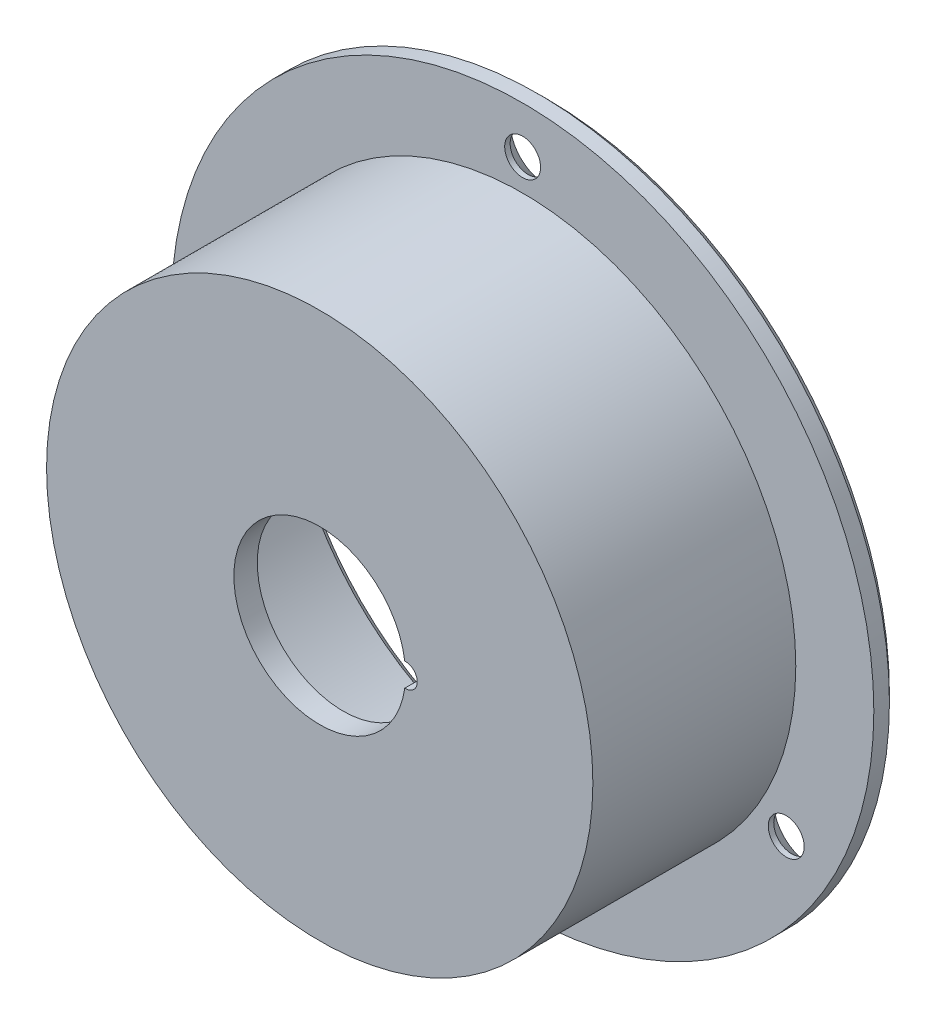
ISO-10303-21;
HEADER;
FILE_DESCRIPTION(('STEP AP214'),'2;1');
FILE_NAME('part.step','',(''),(''),'','','');
FILE_SCHEMA(('AUTOMOTIVE_DESIGN { 1 0 10303 214 1 1 1 1 }'));
ENDSEC;
DATA;
#1=APPLICATION_CONTEXT('core data for automotive mechanical design processes');
#2=APPLICATION_PROTOCOL_DEFINITION('international standard','automotive_design',2000,#1);
#3=PRODUCT_CONTEXT('',#1,'mechanical');
#4=PRODUCT('Part','Part','',(#3));
#5=PRODUCT_RELATED_PRODUCT_CATEGORY('part','',(#4));
#6=PRODUCT_DEFINITION_FORMATION('','',#4);
#7=PRODUCT_DEFINITION_CONTEXT('part definition',#1,'design');
#8=PRODUCT_DEFINITION('design','',#6,#7);
#9=PRODUCT_DEFINITION_SHAPE('','',#8);
#10=(LENGTH_UNIT() NAMED_UNIT(*) SI_UNIT(.MILLI.,.METRE.));
#11=(NAMED_UNIT(*) PLANE_ANGLE_UNIT() SI_UNIT($,.RADIAN.));
#12=(NAMED_UNIT(*) SI_UNIT($,.STERADIAN.) SOLID_ANGLE_UNIT());
#13=UNCERTAINTY_MEASURE_WITH_UNIT(LENGTH_MEASURE(1.E-05),#10,'distance_accuracy_value','');
#14=(GEOMETRIC_REPRESENTATION_CONTEXT(3) GLOBAL_UNCERTAINTY_ASSIGNED_CONTEXT((#13)) GLOBAL_UNIT_ASSIGNED_CONTEXT((#10,
#11,#12)) REPRESENTATION_CONTEXT('',''));
#15=CARTESIAN_POINT('',(0.,0.,0.));
#16=DIRECTION('',(0.,0.,1.));
#17=DIRECTION('',(1.,0.,0.));
#18=AXIS2_PLACEMENT_3D('',#15,#16,#17);
#19=CARTESIAN_POINT('',(0.,0.,3.));
#20=DIRECTION('',(0.,0.,1.));
#21=DIRECTION('',(1.,0.,0.));
#22=AXIS2_PLACEMENT_3D('',#19,#20,#21);
#23=PLANE('',#22);
#24=CARTESIAN_POINT('',(-33.7749907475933,-19.4999999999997,3.));
#25=DIRECTION('',(0.,0.,1.));
#26=DIRECTION('',(-0.499999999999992,0.866025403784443,0.));
#27=AXIS2_PLACEMENT_3D('',#24,#25,#26);
#28=CIRCLE('',#27,2.3);
#29=CARTESIAN_POINT('',(-34.9249907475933,-17.5081415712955,3.));
#30=VERTEX_POINT('',#29);
#31=EDGE_CURVE('E323',#30,#30,#28,.T.);
#32=ORIENTED_EDGE('',*,*,#31,.F.);
#33=EDGE_LOOP('',(#32));
#34=FACE_BOUND('',#33,.T.);
#35=CARTESIAN_POINT('',(33.774990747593,-19.5000000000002,3.));
#36=DIRECTION('',(0.,0.,1.));
#37=DIRECTION('',(-0.500000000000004,-0.866025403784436,0.));
#38=AXIS2_PLACEMENT_3D('',#35,#36,#37);
#39=CIRCLE('',#38,2.3);
#40=CARTESIAN_POINT('',(32.624990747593,-21.4918584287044,3.));
#41=VERTEX_POINT('',#40);
#42=EDGE_CURVE('E327',#41,#41,#39,.T.);
#43=ORIENTED_EDGE('',*,*,#42,.F.);
#44=EDGE_LOOP('',(#43));
#45=FACE_BOUND('',#44,.T.);
#46=CARTESIAN_POINT('',(0.,39.,3.));
#47=DIRECTION('',(0.,0.,1.));
#48=DIRECTION('',(1.,0.,0.));
#49=AXIS2_PLACEMENT_3D('',#46,#47,#48);
#50=CIRCLE('',#49,2.3);
#51=CARTESIAN_POINT('',(2.3,39.,3.));
#52=VERTEX_POINT('',#51);
#53=EDGE_CURVE('E87',#52,#52,#50,.T.);
#54=ORIENTED_EDGE('',*,*,#53,.F.);
#55=EDGE_LOOP('',(#54));
#56=FACE_BOUND('',#55,.T.);
#57=CARTESIAN_POINT('',(0.,0.,3.));
#58=DIRECTION('',(0.,0.,1.));
#59=DIRECTION('',(1.,0.,0.));
#60=AXIS2_PLACEMENT_3D('',#57,#58,#59);
#61=CIRCLE('',#60,45.);
#62=CARTESIAN_POINT('',(45.,0.,3.));
#63=VERTEX_POINT('',#62);
#64=EDGE_CURVE('E97',#63,#63,#61,.T.);
#65=ORIENTED_EDGE('',*,*,#64,.T.);
#66=EDGE_LOOP('',(#65));
#67=FACE_BOUND('',#66,.T.);
#68=CARTESIAN_POINT('',(0.,0.,3.));
#69=DIRECTION('',(0.,0.,1.));
#70=DIRECTION('',(1.,0.,0.));
#71=AXIS2_PLACEMENT_3D('',#68,#69,#70);
#72=CIRCLE('',#71,35.);
#73=CARTESIAN_POINT('',(35.,0.,3.));
#74=VERTEX_POINT('',#73);
#75=EDGE_CURVE('E94',#74,#74,#72,.T.);
#76=ORIENTED_EDGE('',*,*,#75,.F.);
#77=EDGE_LOOP('',(#76));
#78=FACE_BOUND('',#77,.T.);
#79=ADVANCED_FACE('F41',(#34,#45,#56,#67,#78),#23,.T.);
#80=CARTESIAN_POINT('',(0.,0.,0.));
#81=DIRECTION('',(0.,0.,1.));
#82=DIRECTION('',(1.,0.,0.));
#83=AXIS2_PLACEMENT_3D('',#80,#81,#82);
#84=PLANE('',#83);
#85=CARTESIAN_POINT('',(-33.7749907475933,-19.4999999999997,0.));
#86=DIRECTION('',(0.,0.,1.));
#87=DIRECTION('',(1.,0.,0.));
#88=AXIS2_PLACEMENT_3D('',#85,#86,#87);
#89=CIRCLE('',#88,4.60000000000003);
#90=CARTESIAN_POINT('',(-38.3749907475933,-19.4999999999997,0.));
#91=VERTEX_POINT('',#90);
#92=EDGE_CURVE('E133',#91,#91,#89,.T.);
#93=ORIENTED_EDGE('',*,*,#92,.T.);
#94=EDGE_LOOP('',(#93));
#95=FACE_BOUND('',#94,.T.);
#96=CARTESIAN_POINT('',(33.774990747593,-19.5000000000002,0.));
#97=DIRECTION('',(0.,0.,1.));
#98=DIRECTION('',(1.,0.,0.));
#99=AXIS2_PLACEMENT_3D('',#96,#97,#98);
#100=CIRCLE('',#99,4.60000000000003);
#101=CARTESIAN_POINT('',(29.174990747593,-19.5000000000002,0.));
#102=VERTEX_POINT('',#101);
#103=EDGE_CURVE('E125',#102,#102,#100,.T.);
#104=ORIENTED_EDGE('',*,*,#103,.T.);
#105=EDGE_LOOP('',(#104));
#106=FACE_BOUND('',#105,.T.);
#107=CARTESIAN_POINT('',(0.,39.,0.));
#108=DIRECTION('',(0.,0.,1.));
#109=DIRECTION('',(1.,0.,0.));
#110=AXIS2_PLACEMENT_3D('',#107,#108,#109);
#111=CIRCLE('',#110,4.59999999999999);
#112=CARTESIAN_POINT('',(-4.59999999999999,39.,0.));
#113=VERTEX_POINT('',#112);
#114=EDGE_CURVE('E117',#113,#113,#111,.T.);
#115=ORIENTED_EDGE('',*,*,#114,.T.);
#116=EDGE_LOOP('',(#115));
#117=FACE_BOUND('',#116,.T.);
#118=CARTESIAN_POINT('',(0.,0.,0.));
#119=DIRECTION('',(0.,0.,1.));
#120=DIRECTION('',(1.,0.,0.));
#121=AXIS2_PLACEMENT_3D('',#118,#119,#120);
#122=CIRCLE('',#121,44.);
#123=CARTESIAN_POINT('',(44.,0.,0.));
#124=VERTEX_POINT('',#123);
#125=EDGE_CURVE('E109',#124,#124,#122,.F.);
#126=ORIENTED_EDGE('',*,*,#125,.T.);
#127=EDGE_LOOP('',(#126));
#128=FACE_BOUND('',#127,.T.);
#129=CARTESIAN_POINT('',(0.,0.,0.));
#130=DIRECTION('',(0.,0.,1.));
#131=DIRECTION('',(1.,0.,0.));
#132=AXIS2_PLACEMENT_3D('',#129,#130,#131);
#133=CIRCLE('',#132,33.5);
#134=CARTESIAN_POINT('',(33.5,0.,0.));
#135=VERTEX_POINT('',#134);
#136=EDGE_CURVE('E105',#135,#135,#133,.T.);
#137=ORIENTED_EDGE('',*,*,#136,.T.);
#138=EDGE_LOOP('',(#137));
#139=FACE_BOUND('',#138,.T.);
#140=ADVANCED_FACE('F153',(#95,#106,#117,#128,#139),#84,.F.);
#141=CARTESIAN_POINT('',(0.,0.,3.));
#142=DIRECTION('',(0.,0.,-1.));
#143=DIRECTION('',(-1.,0.,0.));
#144=AXIS2_PLACEMENT_3D('',#141,#142,#143);
#145=CYLINDRICAL_SURFACE('',#144,45.);
#146=CARTESIAN_POINT('',(0.,0.,1.00000000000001));
#147=DIRECTION('',(0.,0.,1.));
#148=DIRECTION('',(1.,0.,0.));
#149=AXIS2_PLACEMENT_3D('',#146,#147,#148);
#150=CIRCLE('',#149,45.);
#151=CARTESIAN_POINT('',(45.,0.,1.00000000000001));
#152=VERTEX_POINT('',#151);
#153=EDGE_CURVE('E101',#152,#152,#150,.T.);
#154=ORIENTED_EDGE('',*,*,#153,.T.);
#155=EDGE_LOOP('',(#154));
#156=FACE_BOUND('',#155,.T.);
#157=ORIENTED_EDGE('',*,*,#64,.F.);
#158=EDGE_LOOP('',(#157));
#159=FACE_BOUND('',#158,.T.);
#160=ADVANCED_FACE('F156',(#156,#159),#145,.T.);
#161=CARTESIAN_POINT('',(0.,0.,26.));
#162=DIRECTION('',(0.,0.,-1.));
#163=DIRECTION('',(-1.,0.,0.));
#164=AXIS2_PLACEMENT_3D('',#161,#162,#163);
#165=CYLINDRICAL_SURFACE('',#164,35.);
#166=ORIENTED_EDGE('',*,*,#75,.T.);
#167=EDGE_LOOP('',(#166));
#168=FACE_BOUND('',#167,.T.);
#169=CARTESIAN_POINT('',(0.,0.,29.));
#170=DIRECTION('',(0.,0.,1.));
#171=DIRECTION('',(1.,0.,0.));
#172=AXIS2_PLACEMENT_3D('',#169,#170,#171);
#173=CIRCLE('',#172,35.);
#174=CARTESIAN_POINT('',(35.,0.,29.));
#175=VERTEX_POINT('',#174);
#176=EDGE_CURVE('E78',#175,#175,#173,.T.);
#177=ORIENTED_EDGE('',*,*,#176,.F.);
#178=EDGE_LOOP('',(#177));
#179=FACE_BOUND('',#178,.T.);
#180=ADVANCED_FACE('F191',(#168,#179),#165,.T.);
#181=CARTESIAN_POINT('',(0.,0.,26.));
#182=DIRECTION('',(0.,0.,-1.));
#183=DIRECTION('',(-1.,0.,0.));
#184=AXIS2_PLACEMENT_3D('',#181,#182,#183);
#185=CYLINDRICAL_SURFACE('',#184,32.5);
#186=CARTESIAN_POINT('',(0.,0.,1.00000000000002));
#187=DIRECTION('',(0.,0.,1.));
#188=DIRECTION('',(1.,0.,0.));
#189=AXIS2_PLACEMENT_3D('',#186,#187,#188);
#190=CIRCLE('',#189,32.5);
#191=CARTESIAN_POINT('',(32.5,0.,1.00000000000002));
#192=VERTEX_POINT('',#191);
#193=EDGE_CURVE('E113',#192,#192,#190,.F.);
#194=ORIENTED_EDGE('',*,*,#193,.T.);
#195=EDGE_LOOP('',(#194));
#196=FACE_BOUND('',#195,.T.);
#197=CARTESIAN_POINT('',(0.,0.,26.));
#198=DIRECTION('',(0.,0.,1.));
#199=DIRECTION('',(1.,0.,0.));
#200=AXIS2_PLACEMENT_3D('',#197,#198,#199);
#201=CIRCLE('',#200,32.5);
#202=CARTESIAN_POINT('',(32.5,0.,26.));
#203=VERTEX_POINT('',#202);
#204=EDGE_CURVE('E85',#203,#203,#201,.T.);
#205=ORIENTED_EDGE('',*,*,#204,.T.);
#206=EDGE_LOOP('',(#205));
#207=FACE_BOUND('',#206,.T.);
#208=ADVANCED_FACE('F199',(#196,#207),#185,.F.);
#209=CARTESIAN_POINT('',(0.,0.,26.));
#210=DIRECTION('',(0.,0.,1.));
#211=DIRECTION('',(1.,0.,0.));
#212=AXIS2_PLACEMENT_3D('',#209,#210,#211);
#213=PLANE('',#212);
#214=CARTESIAN_POINT('',(0.,0.,26.));
#215=DIRECTION('',(0.,0.,1.));
#216=DIRECTION('',(1.,0.,0.));
#217=AXIS2_PLACEMENT_3D('',#214,#215,#216);
#218=CIRCLE('',#217,11.);
#219=CARTESIAN_POINT('',(10.8977272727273,1.49650936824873,26.));
#220=VERTEX_POINT('',#219);
#221=CARTESIAN_POINT('',(10.8977272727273,-1.49650936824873,26.));
#222=VERTEX_POINT('',#221);
#223=EDGE_CURVE('E74',#220,#222,#218,.T.);
#224=ORIENTED_EDGE('',*,*,#223,.T.);
#225=CARTESIAN_POINT('',(11.,0.,26.));
#226=DIRECTION('',(0.,0.,-1.));
#227=DIRECTION('',(-1.,0.,0.));
#228=AXIS2_PLACEMENT_3D('',#225,#226,#227);
#229=CIRCLE('',#228,1.5);
#230=EDGE_CURVE('E56',#220,#222,#229,.T.);
#231=ORIENTED_EDGE('',*,*,#230,.F.);
#232=EDGE_LOOP('',(#224,#231));
#233=FACE_BOUND('',#232,.T.);
#234=ORIENTED_EDGE('',*,*,#204,.F.);
#235=EDGE_LOOP('',(#234));
#236=FACE_BOUND('',#235,.T.);
#237=ADVANCED_FACE('F72',(#233,#236),#213,.F.);
#238=CARTESIAN_POINT('',(0.,0.,29.));
#239=DIRECTION('',(0.,0.,1.));
#240=DIRECTION('',(1.,0.,0.));
#241=AXIS2_PLACEMENT_3D('',#238,#239,#240);
#242=PLANE('',#241);
#243=CARTESIAN_POINT('',(11.,0.,29.));
#244=DIRECTION('',(0.,0.,1.));
#245=DIRECTION('',(1.,0.,0.));
#246=AXIS2_PLACEMENT_3D('',#243,#244,#245);
#247=CIRCLE('',#246,1.5);
#248=CARTESIAN_POINT('',(10.8977272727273,-1.49650936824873,29.));
#249=VERTEX_POINT('',#248);
#250=CARTESIAN_POINT('',(10.8977272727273,1.49650936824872,29.));
#251=VERTEX_POINT('',#250);
#252=EDGE_CURVE('E61',#249,#251,#247,.T.);
#253=ORIENTED_EDGE('',*,*,#252,.F.);
#254=CARTESIAN_POINT('',(0.,0.,29.));
#255=DIRECTION('',(0.,0.,1.));
#256=DIRECTION('',(1.,0.,0.));
#257=AXIS2_PLACEMENT_3D('',#254,#255,#256);
#258=CIRCLE('',#257,11.);
#259=EDGE_CURVE('E79',#251,#249,#258,.T.);
#260=ORIENTED_EDGE('',*,*,#259,.F.);
#261=EDGE_LOOP('',(#253,#260));
#262=FACE_BOUND('',#261,.T.);
#263=ORIENTED_EDGE('',*,*,#176,.T.);
#264=EDGE_LOOP('',(#263));
#265=FACE_BOUND('',#264,.T.);
#266=ADVANCED_FACE('F210',(#262,#265),#242,.T.);
#267=CARTESIAN_POINT('',(0.,0.,26.));
#268=DIRECTION('',(0.,0.,1.));
#269=DIRECTION('',(1.,0.,0.));
#270=AXIS2_PLACEMENT_3D('',#267,#268,#269);
#271=CYLINDRICAL_SURFACE('',#270,11.);
#272=ORIENTED_EDGE('',*,*,#223,.F.);
#273=DIRECTION('',(0.,0.,-1.));
#274=VECTOR('',#273,1.);
#275=CARTESIAN_POINT('',(10.8977272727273,1.49650936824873,31.));
#276=LINE('',#275,#274);
#277=EDGE_CURVE('E11',#220,#251,#276,.F.);
#278=ORIENTED_EDGE('',*,*,#277,.T.);
#279=ORIENTED_EDGE('',*,*,#259,.T.);
#280=DIRECTION('',(0.,0.,-1.));
#281=VECTOR('',#280,1.);
#282=CARTESIAN_POINT('',(10.8977272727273,-1.49650936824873,31.));
#283=LINE('',#282,#281);
#284=EDGE_CURVE('E49',#249,#222,#283,.T.);
#285=ORIENTED_EDGE('',*,*,#284,.T.);
#286=EDGE_LOOP('',(#272,#278,#279,#285));
#287=FACE_BOUND('',#286,.T.);
#288=ADVANCED_FACE('F76',(#287),#271,.F.);
#289=CARTESIAN_POINT('',(0.,0.,1.00000000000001));
#290=DIRECTION('',(0.,0.,1.));
#291=DIRECTION('',(1.,0.,0.));
#292=AXIS2_PLACEMENT_3D('',#289,#290,#291);
#293=CONICAL_SURFACE('',#292,45.,0.785398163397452);
#294=ORIENTED_EDGE('',*,*,#125,.F.);
#295=EDGE_LOOP('',(#294));
#296=FACE_BOUND('',#295,.T.);
#297=ORIENTED_EDGE('',*,*,#153,.F.);
#298=EDGE_LOOP('',(#297));
#299=FACE_BOUND('',#298,.T.);
#300=ADVANCED_FACE('F169',(#296,#299),#293,.T.);
#301=CARTESIAN_POINT('',(0.,0.,0.));
#302=DIRECTION('',(0.,0.,-1.));
#303=DIRECTION('',(-1.,0.,0.));
#304=AXIS2_PLACEMENT_3D('',#301,#302,#303);
#305=CONICAL_SURFACE('',#304,33.5,0.785398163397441);
#306=ORIENTED_EDGE('',*,*,#193,.F.);
#307=EDGE_LOOP('',(#306));
#308=FACE_BOUND('',#307,.T.);
#309=ORIENTED_EDGE('',*,*,#136,.F.);
#310=EDGE_LOOP('',(#309));
#311=FACE_BOUND('',#310,.T.);
#312=ADVANCED_FACE('F166',(#308,#311),#305,.F.);
#313=CARTESIAN_POINT('',(0.,39.,-7.));
#314=DIRECTION('',(0.,0.,1.));
#315=DIRECTION('',(1.,0.,0.));
#316=AXIS2_PLACEMENT_3D('',#313,#314,#315);
#317=CYLINDRICAL_SURFACE('',#316,2.3);
#318=CARTESIAN_POINT('',(0.,39.,2.29999999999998));
#319=DIRECTION('',(0.,0.,1.));
#320=DIRECTION('',(1.,0.,0.));
#321=AXIS2_PLACEMENT_3D('',#318,#319,#320);
#322=CIRCLE('',#321,2.3);
#323=CARTESIAN_POINT('',(-2.3,39.,2.29999999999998));
#324=VERTEX_POINT('',#323);
#325=EDGE_CURVE('E121',#324,#324,#322,.F.);
#326=ORIENTED_EDGE('',*,*,#325,.T.);
#327=EDGE_LOOP('',(#326));
#328=FACE_BOUND('',#327,.T.);
#329=ORIENTED_EDGE('',*,*,#53,.T.);
#330=EDGE_LOOP('',(#329));
#331=FACE_BOUND('',#330,.T.);
#332=ADVANCED_FACE('F168',(#328,#331),#317,.F.);
#333=CARTESIAN_POINT('',(0.,39.,0.));
#334=DIRECTION('',(0.,0.,-1.));
#335=DIRECTION('',(-1.,0.,0.));
#336=AXIS2_PLACEMENT_3D('',#333,#334,#335);
#337=CONICAL_SURFACE('',#336,4.59999999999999,0.78539816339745);
#338=CARTESIAN_POINT('',(-2.3,39.,2.29999999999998));
#339=CARTESIAN_POINT('',(-2.32395833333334,39.,2.27604166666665));
#340=CARTESIAN_POINT('',(-2.34791666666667,39.,2.25208333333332));
#341=CARTESIAN_POINT('',(-2.39583333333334,39.,2.20416666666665));
#342=CARTESIAN_POINT('',(-2.41979166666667,39.,2.18020833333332));
#343=CARTESIAN_POINT('',(-2.46770833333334,39.,2.13229166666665));
#344=CARTESIAN_POINT('',(-2.49166666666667,39.,2.10833333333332));
#345=CARTESIAN_POINT('',(-2.53958333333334,39.,2.06041666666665));
#346=CARTESIAN_POINT('',(-2.56354166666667,39.,2.03645833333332));
#347=CARTESIAN_POINT('',(-2.61145833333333,39.,1.98854166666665));
#348=CARTESIAN_POINT('',(-2.63541666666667,39.,1.96458333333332));
#349=CARTESIAN_POINT('',(-2.68333333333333,39.,1.91666666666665));
#350=CARTESIAN_POINT('',(-2.70729166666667,39.,1.89270833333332));
#351=CARTESIAN_POINT('',(-2.75520833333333,39.,1.84479166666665));
#352=CARTESIAN_POINT('',(-2.77916666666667,39.,1.82083333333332));
#353=CARTESIAN_POINT('',(-2.82708333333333,39.,1.77291666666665));
#354=CARTESIAN_POINT('',(-2.85104166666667,39.,1.74895833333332));
#355=CARTESIAN_POINT('',(-2.89895833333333,39.,1.70104166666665));
#356=CARTESIAN_POINT('',(-2.92291666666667,39.,1.67708333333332));
#357=CARTESIAN_POINT('',(-2.97083333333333,39.,1.62916666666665));
#358=CARTESIAN_POINT('',(-2.99479166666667,39.,1.60520833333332));
#359=CARTESIAN_POINT('',(-3.04270833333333,39.,1.55729166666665));
#360=CARTESIAN_POINT('',(-3.06666666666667,39.,1.53333333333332));
#361=CARTESIAN_POINT('',(-3.11458333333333,39.,1.48541666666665));
#362=CARTESIAN_POINT('',(-3.13854166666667,39.,1.46145833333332));
#363=CARTESIAN_POINT('',(-3.18645833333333,39.,1.41354166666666));
#364=CARTESIAN_POINT('',(-3.21041666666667,39.,1.38958333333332));
#365=CARTESIAN_POINT('',(-3.25833333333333,39.,1.34166666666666));
#366=CARTESIAN_POINT('',(-3.28229166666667,39.,1.31770833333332));
#367=CARTESIAN_POINT('',(-3.33020833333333,39.,1.26979166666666));
#368=CARTESIAN_POINT('',(-3.35416666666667,39.,1.24583333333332));
#369=CARTESIAN_POINT('',(-3.40208333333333,39.,1.19791666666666));
#370=CARTESIAN_POINT('',(-3.42604166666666,39.,1.17395833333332));
#371=CARTESIAN_POINT('',(-3.47395833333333,39.,1.12604166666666));
#372=CARTESIAN_POINT('',(-3.49791666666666,39.,1.10208333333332));
#373=CARTESIAN_POINT('',(-3.54583333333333,39.,1.05416666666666));
#374=CARTESIAN_POINT('',(-3.56979166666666,39.,1.03020833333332));
#375=CARTESIAN_POINT('',(-3.61770833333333,39.,0.982291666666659));
#376=CARTESIAN_POINT('',(-3.64166666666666,39.,0.958333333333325));
#377=CARTESIAN_POINT('',(-3.68958333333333,39.,0.910416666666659));
#378=CARTESIAN_POINT('',(-3.71354166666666,39.,0.886458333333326));
#379=CARTESIAN_POINT('',(-3.76145833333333,39.,0.83854166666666));
#380=CARTESIAN_POINT('',(-3.78541666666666,39.,0.814583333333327));
#381=CARTESIAN_POINT('',(-3.83333333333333,39.,0.766666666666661));
#382=CARTESIAN_POINT('',(-3.85729166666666,39.,0.742708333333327));
#383=CARTESIAN_POINT('',(-3.90520833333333,39.,0.694791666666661));
#384=CARTESIAN_POINT('',(-3.92916666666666,39.,0.670833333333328));
#385=CARTESIAN_POINT('',(-3.97708333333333,39.,0.622916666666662));
#386=CARTESIAN_POINT('',(-4.00104166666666,39.,0.598958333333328));
#387=CARTESIAN_POINT('',(-4.04895833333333,39.,0.551041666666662));
#388=CARTESIAN_POINT('',(-4.07291666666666,39.,0.527083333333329));
#389=CARTESIAN_POINT('',(-4.12083333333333,39.,0.479166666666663));
#390=CARTESIAN_POINT('',(-4.14479166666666,39.,0.45520833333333));
#391=CARTESIAN_POINT('',(-4.19270833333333,39.,0.407291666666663));
#392=CARTESIAN_POINT('',(-4.21666666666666,39.,0.38333333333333));
#393=CARTESIAN_POINT('',(-4.26458333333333,39.,0.335416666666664));
#394=CARTESIAN_POINT('',(-4.28854166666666,39.,0.311458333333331));
#395=CARTESIAN_POINT('',(-4.33645833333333,39.,0.263541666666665));
#396=CARTESIAN_POINT('',(-4.36041666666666,39.,0.239583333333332));
#397=CARTESIAN_POINT('',(-4.40833333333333,39.,0.191666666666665));
#398=CARTESIAN_POINT('',(-4.43229166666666,39.,0.167708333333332));
#399=CARTESIAN_POINT('',(-4.48020833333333,39.,0.119791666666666));
#400=CARTESIAN_POINT('',(-4.50416666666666,39.,0.0958333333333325));
#401=CARTESIAN_POINT('',(-4.55208333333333,39.,0.0479166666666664));
#402=CARTESIAN_POINT('',(-4.57604166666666,39.,0.0239583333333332));
#403=CARTESIAN_POINT('',(-4.59999999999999,39.,0.));
#404=B_SPLINE_CURVE_WITH_KNOTS('',3,(#338,#339,#340,#341,#342,#343,#344,#345,#346,#347,#348,
#349,#350,#351,#352,#353,#354,#355,#356,#357,#358,#359,#360,#361,#362,#363,#364,#365,#366,#367,
#368,#369,#370,#371,#372,#373,#374,#375,#376,#377,#378,#379,#380,#381,#382,#383,#384,#385,#386,
#387,#388,#389,#390,#391,#392,#393,#394,#395,#396,#397,#398,#399,#400,#401,#402,#403),
.UNSPECIFIED.,.F.,.F.,(4,2,2,2,2,2,2,2,2,2,2,2,2,2,2,2,2,2,2,2,2,2,2,2,2,2,2,2,2,2,2,2,4),(0.,
0.101646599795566,0.203293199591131,0.304939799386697,0.406586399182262,0.508232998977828,
0.609879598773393,0.711526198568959,0.813172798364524,0.91481939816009,1.01646599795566,
1.11811259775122,1.21975919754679,1.32140579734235,1.42305239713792,1.52469899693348,
1.62634559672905,1.72799219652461,1.82963879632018,1.93128539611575,2.03293199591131,
2.13457859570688,2.23622519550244,2.33787179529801,2.43951839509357,2.54116499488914,
2.6428115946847,2.74445819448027,2.84610479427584,2.9477513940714,3.04939799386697,
3.15104459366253,3.2526911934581),.UNSPECIFIED.);
#405=EDGE_CURVE('BSEAM176',#324,#113,#404,.T.);
#406=ORIENTED_EDGE('',*,*,#325,.F.);
#407=ORIENTED_EDGE('',*,*,#114,.F.);
#408=ORIENTED_EDGE('',*,*,#405,.T.);
#409=ORIENTED_EDGE('',*,*,#405,.F.);
#410=EDGE_LOOP('',(#406,#408,#407,#409));
#411=FACE_BOUND('',#410,.T.);
#412=ADVANCED_FACE('F176',(#411),#337,.F.);
#413=CARTESIAN_POINT('',(33.774990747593,-19.5000000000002,-7.));
#414=DIRECTION('',(0.,0.,1.));
#415=DIRECTION('',(1.,0.,0.));
#416=AXIS2_PLACEMENT_3D('',#413,#414,#415);
#417=CYLINDRICAL_SURFACE('',#416,2.3);
#418=CARTESIAN_POINT('',(33.774990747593,-19.5000000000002,2.30000000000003));
#419=DIRECTION('',(0.,0.,1.));
#420=DIRECTION('',(1.,0.,0.));
#421=AXIS2_PLACEMENT_3D('',#418,#419,#420);
#422=CIRCLE('',#421,2.3);
#423=CARTESIAN_POINT('',(31.474990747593,-19.5000000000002,2.30000000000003));
#424=VERTEX_POINT('',#423);
#425=EDGE_CURVE('E129',#424,#424,#422,.F.);
#426=ORIENTED_EDGE('',*,*,#425,.T.);
#427=EDGE_LOOP('',(#426));
#428=FACE_BOUND('',#427,.T.);
#429=ORIENTED_EDGE('',*,*,#42,.T.);
#430=EDGE_LOOP('',(#429));
#431=FACE_BOUND('',#430,.T.);
#432=ADVANCED_FACE('F271',(#428,#431),#417,.F.);
#433=CARTESIAN_POINT('',(-33.7749907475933,-19.4999999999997,-7.));
#434=DIRECTION('',(0.,0.,1.));
#435=DIRECTION('',(1.,0.,0.));
#436=AXIS2_PLACEMENT_3D('',#433,#434,#435);
#437=CYLINDRICAL_SURFACE('',#436,2.3);
#438=CARTESIAN_POINT('',(-33.7749907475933,-19.4999999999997,2.30000000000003));
#439=DIRECTION('',(0.,0.,1.));
#440=DIRECTION('',(1.,0.,0.));
#441=AXIS2_PLACEMENT_3D('',#438,#439,#440);
#442=CIRCLE('',#441,2.3);
#443=CARTESIAN_POINT('',(-36.0749907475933,-19.4999999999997,2.30000000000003));
#444=VERTEX_POINT('',#443);
#445=EDGE_CURVE('E137',#444,#444,#442,.F.);
#446=ORIENTED_EDGE('',*,*,#445,.T.);
#447=EDGE_LOOP('',(#446));
#448=FACE_BOUND('',#447,.T.);
#449=ORIENTED_EDGE('',*,*,#31,.T.);
#450=EDGE_LOOP('',(#449));
#451=FACE_BOUND('',#450,.T.);
#452=ADVANCED_FACE('F145',(#448,#451),#437,.F.);
#453=CARTESIAN_POINT('',(33.774990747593,-19.5000000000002,0.));
#454=DIRECTION('',(0.,0.,-1.));
#455=DIRECTION('',(-1.,0.,0.));
#456=AXIS2_PLACEMENT_3D('',#453,#454,#455);
#457=CONICAL_SURFACE('',#456,4.60000000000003,0.78539816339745);
#458=CARTESIAN_POINT('',(31.474990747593,-19.5000000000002,2.30000000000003));
#459=CARTESIAN_POINT('',(31.4510324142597,-19.5000000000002,2.27604166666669));
#460=CARTESIAN_POINT('',(31.4270740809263,-19.5000000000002,2.25208333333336));
#461=CARTESIAN_POINT('',(31.3791574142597,-19.5000000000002,2.20416666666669));
#462=CARTESIAN_POINT('',(31.3551990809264,-19.5000000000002,2.18020833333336));
#463=CARTESIAN_POINT('',(31.3072824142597,-19.5000000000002,2.13229166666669));
#464=CARTESIAN_POINT('',(31.2833240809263,-19.5000000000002,2.10833333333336));
#465=CARTESIAN_POINT('',(31.2354074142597,-19.5000000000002,2.06041666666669));
#466=CARTESIAN_POINT('',(31.2114490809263,-19.5000000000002,2.03645833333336));
#467=CARTESIAN_POINT('',(31.1635324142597,-19.5000000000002,1.98854166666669));
#468=CARTESIAN_POINT('',(31.1395740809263,-19.5000000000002,1.96458333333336));
#469=CARTESIAN_POINT('',(31.0916574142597,-19.5000000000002,1.91666666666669));
#470=CARTESIAN_POINT('',(31.0676990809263,-19.5000000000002,1.89270833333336));
#471=CARTESIAN_POINT('',(31.0197824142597,-19.5000000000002,1.84479166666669));
#472=CARTESIAN_POINT('',(30.9958240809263,-19.5000000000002,1.82083333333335));
#473=CARTESIAN_POINT('',(30.9479074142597,-19.5000000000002,1.77291666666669));
#474=CARTESIAN_POINT('',(30.9239490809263,-19.5000000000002,1.74895833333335));
#475=CARTESIAN_POINT('',(30.8760324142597,-19.5000000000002,1.70104166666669));
#476=CARTESIAN_POINT('',(30.8520740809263,-19.5000000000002,1.67708333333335));
#477=CARTESIAN_POINT('',(30.8041574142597,-19.5000000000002,1.62916666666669));
#478=CARTESIAN_POINT('',(30.7801990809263,-19.5000000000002,1.60520833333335));
#479=CARTESIAN_POINT('',(30.7322824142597,-19.5000000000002,1.55729166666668));
#480=CARTESIAN_POINT('',(30.7083240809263,-19.5000000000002,1.53333333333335));
#481=CARTESIAN_POINT('',(30.6604074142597,-19.5000000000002,1.48541666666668));
#482=CARTESIAN_POINT('',(30.6364490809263,-19.5000000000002,1.46145833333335));
#483=CARTESIAN_POINT('',(30.5885324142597,-19.5000000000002,1.41354166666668));
#484=CARTESIAN_POINT('',(30.5645740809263,-19.5000000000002,1.38958333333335));
#485=CARTESIAN_POINT('',(30.5166574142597,-19.5000000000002,1.34166666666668));
#486=CARTESIAN_POINT('',(30.4926990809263,-19.5000000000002,1.31770833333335));
#487=CARTESIAN_POINT('',(30.4447824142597,-19.5000000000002,1.26979166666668));
#488=CARTESIAN_POINT('',(30.4208240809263,-19.5000000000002,1.24583333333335));
#489=CARTESIAN_POINT('',(30.3729074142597,-19.5000000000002,1.19791666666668));
#490=CARTESIAN_POINT('',(30.3489490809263,-19.5000000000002,1.17395833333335));
#491=CARTESIAN_POINT('',(30.3010324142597,-19.5000000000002,1.12604166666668));
#492=CARTESIAN_POINT('',(30.2770740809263,-19.5000000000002,1.10208333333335));
#493=CARTESIAN_POINT('',(30.2291574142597,-19.5000000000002,1.05416666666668));
#494=CARTESIAN_POINT('',(30.2051990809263,-19.5000000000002,1.03020833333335));
#495=CARTESIAN_POINT('',(30.1572824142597,-19.5000000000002,0.982291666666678));
#496=CARTESIAN_POINT('',(30.1333240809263,-19.5000000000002,0.958333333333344));
#497=CARTESIAN_POINT('',(30.0854074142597,-19.5000000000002,0.910416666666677));
#498=CARTESIAN_POINT('',(30.0614490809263,-19.5000000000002,0.886458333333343));
#499=CARTESIAN_POINT('',(30.0135324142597,-19.5000000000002,0.838541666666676));
#500=CARTESIAN_POINT('',(29.9895740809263,-19.5000000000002,0.814583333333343));
#501=CARTESIAN_POINT('',(29.9416574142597,-19.5000000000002,0.766666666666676));
#502=CARTESIAN_POINT('',(29.9176990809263,-19.5000000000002,0.742708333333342));
#503=CARTESIAN_POINT('',(29.8697824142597,-19.5000000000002,0.694791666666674));
#504=CARTESIAN_POINT('',(29.8458240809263,-19.5000000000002,0.670833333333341));
#505=CARTESIAN_POINT('',(29.7979074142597,-19.5000000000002,0.622916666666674));
#506=CARTESIAN_POINT('',(29.7739490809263,-19.5000000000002,0.59895833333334));
#507=CARTESIAN_POINT('',(29.7260324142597,-19.5000000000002,0.551041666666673));
#508=CARTESIAN_POINT('',(29.7020740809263,-19.5000000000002,0.52708333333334));
#509=CARTESIAN_POINT('',(29.6541574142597,-19.5000000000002,0.479166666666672));
#510=CARTESIAN_POINT('',(29.6301990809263,-19.5000000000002,0.455208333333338));
#511=CARTESIAN_POINT('',(29.5822824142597,-19.5000000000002,0.407291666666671));
#512=CARTESIAN_POINT('',(29.5583240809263,-19.5000000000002,0.383333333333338));
#513=CARTESIAN_POINT('',(29.5104074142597,-19.5000000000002,0.335416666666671));
#514=CARTESIAN_POINT('',(29.4864490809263,-19.5000000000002,0.311458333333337));
#515=CARTESIAN_POINT('',(29.4385324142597,-19.5000000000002,0.26354166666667));
#516=CARTESIAN_POINT('',(29.4145740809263,-19.5000000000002,0.239583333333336));
#517=CARTESIAN_POINT('',(29.3666574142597,-19.5000000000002,0.191666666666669));
#518=CARTESIAN_POINT('',(29.3426990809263,-19.5000000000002,0.167708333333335));
#519=CARTESIAN_POINT('',(29.2947824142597,-19.5000000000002,0.119791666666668));
#520=CARTESIAN_POINT('',(29.2708240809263,-19.5000000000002,0.0958333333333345));
#521=CARTESIAN_POINT('',(29.2229074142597,-19.5000000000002,0.0479166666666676));
#522=CARTESIAN_POINT('',(29.1989490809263,-19.5000000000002,0.0239583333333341));
#523=CARTESIAN_POINT('',(29.174990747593,-19.5000000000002,0.));
#524=B_SPLINE_CURVE_WITH_KNOTS('',3,(#458,#459,#460,#461,#462,#463,#464,#465,#466,#467,#468,
#469,#470,#471,#472,#473,#474,#475,#476,#477,#478,#479,#480,#481,#482,#483,#484,#485,#486,#487,
#488,#489,#490,#491,#492,#493,#494,#495,#496,#497,#498,#499,#500,#501,#502,#503,#504,#505,#506,
#507,#508,#509,#510,#511,#512,#513,#514,#515,#516,#517,#518,#519,#520,#521,#522,#523),
.UNSPECIFIED.,.F.,.F.,(4,2,2,2,2,2,2,2,2,2,2,2,2,2,2,2,2,2,2,2,2,2,2,2,2,2,2,2,2,2,2,2,4),(0.,
0.101646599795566,0.203293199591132,0.304939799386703,0.406586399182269,0.508232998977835,
0.609879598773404,0.711526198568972,0.813172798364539,0.914819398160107,1.01646599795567,
1.11811259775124,1.21975919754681,1.32140579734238,1.42305239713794,1.52469899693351,
1.62634559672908,1.72799219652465,1.82963879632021,1.93128539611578,2.03293199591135,
2.13457859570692,2.23622519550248,2.33787179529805,2.43951839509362,2.54116499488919,
2.64281159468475,2.74445819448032,2.84610479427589,2.94775139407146,3.04939799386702,
3.15104459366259,3.25269119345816),.UNSPECIFIED.);
#525=EDGE_CURVE('BSEAM150',#424,#102,#524,.T.);
#526=ORIENTED_EDGE('',*,*,#425,.F.);
#527=ORIENTED_EDGE('',*,*,#103,.F.);
#528=ORIENTED_EDGE('',*,*,#525,.T.);
#529=ORIENTED_EDGE('',*,*,#525,.F.);
#530=EDGE_LOOP('',(#526,#528,#527,#529));
#531=FACE_BOUND('',#530,.T.);
#532=ADVANCED_FACE('F150',(#531),#457,.F.);
#533=CARTESIAN_POINT('',(-33.7749907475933,-19.4999999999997,0.));
#534=DIRECTION('',(0.,0.,-1.));
#535=DIRECTION('',(-1.,0.,0.));
#536=AXIS2_PLACEMENT_3D('',#533,#534,#535);
#537=CONICAL_SURFACE('',#536,4.60000000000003,0.78539816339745);
#538=CARTESIAN_POINT('',(-36.0749907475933,-19.4999999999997,2.30000000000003));
#539=CARTESIAN_POINT('',(-36.0989490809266,-19.4999999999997,2.27604166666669));
#540=CARTESIAN_POINT('',(-36.12290741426,-19.4999999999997,2.25208333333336));
#541=CARTESIAN_POINT('',(-36.1708240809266,-19.4999999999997,2.20416666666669));
#542=CARTESIAN_POINT('',(-36.19478241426,-19.4999999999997,2.18020833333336));
#543=CARTESIAN_POINT('',(-36.2426990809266,-19.4999999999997,2.13229166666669));
#544=CARTESIAN_POINT('',(-36.26665741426,-19.4999999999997,2.10833333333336));
#545=CARTESIAN_POINT('',(-36.3145740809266,-19.4999999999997,2.06041666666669));
#546=CARTESIAN_POINT('',(-36.33853241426,-19.4999999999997,2.03645833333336));
#547=CARTESIAN_POINT('',(-36.3864490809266,-19.4999999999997,1.98854166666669));
#548=CARTESIAN_POINT('',(-36.41040741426,-19.4999999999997,1.96458333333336));
#549=CARTESIAN_POINT('',(-36.4583240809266,-19.4999999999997,1.91666666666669));
#550=CARTESIAN_POINT('',(-36.48228241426,-19.4999999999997,1.89270833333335));
#551=CARTESIAN_POINT('',(-36.5301990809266,-19.4999999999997,1.84479166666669));
#552=CARTESIAN_POINT('',(-36.55415741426,-19.4999999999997,1.82083333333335));
#553=CARTESIAN_POINT('',(-36.6020740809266,-19.4999999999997,1.77291666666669));
#554=CARTESIAN_POINT('',(-36.62603241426,-19.4999999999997,1.74895833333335));
#555=CARTESIAN_POINT('',(-36.6739490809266,-19.4999999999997,1.70104166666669));
#556=CARTESIAN_POINT('',(-36.69790741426,-19.4999999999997,1.67708333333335));
#557=CARTESIAN_POINT('',(-36.7458240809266,-19.4999999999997,1.62916666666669));
#558=CARTESIAN_POINT('',(-36.76978241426,-19.4999999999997,1.60520833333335));
#559=CARTESIAN_POINT('',(-36.8176990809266,-19.4999999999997,1.55729166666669));
#560=CARTESIAN_POINT('',(-36.84165741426,-19.4999999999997,1.53333333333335));
#561=CARTESIAN_POINT('',(-36.8895740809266,-19.4999999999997,1.48541666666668));
#562=CARTESIAN_POINT('',(-36.91353241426,-19.4999999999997,1.46145833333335));
#563=CARTESIAN_POINT('',(-36.9614490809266,-19.4999999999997,1.41354166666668));
#564=CARTESIAN_POINT('',(-36.98540741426,-19.4999999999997,1.38958333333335));
#565=CARTESIAN_POINT('',(-37.0333240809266,-19.4999999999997,1.34166666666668));
#566=CARTESIAN_POINT('',(-37.05728241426,-19.4999999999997,1.31770833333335));
#567=CARTESIAN_POINT('',(-37.1051990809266,-19.4999999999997,1.26979166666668));
#568=CARTESIAN_POINT('',(-37.12915741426,-19.4999999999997,1.24583333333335));
#569=CARTESIAN_POINT('',(-37.1770740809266,-19.4999999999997,1.19791666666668));
#570=CARTESIAN_POINT('',(-37.20103241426,-19.4999999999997,1.17395833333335));
#571=CARTESIAN_POINT('',(-37.2489490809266,-19.4999999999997,1.12604166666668));
#572=CARTESIAN_POINT('',(-37.27290741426,-19.4999999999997,1.10208333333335));
#573=CARTESIAN_POINT('',(-37.3208240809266,-19.4999999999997,1.05416666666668));
#574=CARTESIAN_POINT('',(-37.34478241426,-19.4999999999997,1.03020833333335));
#575=CARTESIAN_POINT('',(-37.3926990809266,-19.4999999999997,0.982291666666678));
#576=CARTESIAN_POINT('',(-37.41665741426,-19.4999999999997,0.958333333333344));
#577=CARTESIAN_POINT('',(-37.4645740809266,-19.4999999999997,0.910416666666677));
#578=CARTESIAN_POINT('',(-37.48853241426,-19.4999999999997,0.886458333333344));
#579=CARTESIAN_POINT('',(-37.5364490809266,-19.4999999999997,0.838541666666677));
#580=CARTESIAN_POINT('',(-37.56040741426,-19.4999999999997,0.814583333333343));
#581=CARTESIAN_POINT('',(-37.6083240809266,-19.4999999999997,0.766666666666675));
#582=CARTESIAN_POINT('',(-37.63228241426,-19.4999999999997,0.742708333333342));
#583=CARTESIAN_POINT('',(-37.6801990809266,-19.4999999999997,0.694791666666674));
#584=CARTESIAN_POINT('',(-37.70415741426,-19.4999999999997,0.67083333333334));
#585=CARTESIAN_POINT('',(-37.7520740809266,-19.4999999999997,0.622916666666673));
#586=CARTESIAN_POINT('',(-37.77603241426,-19.4999999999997,0.598958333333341));
#587=CARTESIAN_POINT('',(-37.8239490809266,-19.4999999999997,0.551041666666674));
#588=CARTESIAN_POINT('',(-37.84790741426,-19.4999999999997,0.52708333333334));
#589=CARTESIAN_POINT('',(-37.8958240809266,-19.4999999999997,0.479166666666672));
#590=CARTESIAN_POINT('',(-37.91978241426,-19.4999999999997,0.455208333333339));
#591=CARTESIAN_POINT('',(-37.9676990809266,-19.4999999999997,0.407291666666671));
#592=CARTESIAN_POINT('',(-37.99165741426,-19.4999999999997,0.383333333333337));
#593=CARTESIAN_POINT('',(-38.0395740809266,-19.4999999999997,0.33541666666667));
#594=CARTESIAN_POINT('',(-38.06353241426,-19.4999999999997,0.311458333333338));
#595=CARTESIAN_POINT('',(-38.1114490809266,-19.4999999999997,0.26354166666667));
#596=CARTESIAN_POINT('',(-38.13540741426,-19.4999999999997,0.239583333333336));
#597=CARTESIAN_POINT('',(-38.1833240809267,-19.4999999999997,0.191666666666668));
#598=CARTESIAN_POINT('',(-38.20728241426,-19.4999999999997,0.167708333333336));
#599=CARTESIAN_POINT('',(-38.2551990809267,-19.4999999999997,0.119791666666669));
#600=CARTESIAN_POINT('',(-38.27915741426,-19.4999999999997,0.0958333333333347));
#601=CARTESIAN_POINT('',(-38.3270740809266,-19.4999999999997,0.0479166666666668));
#602=CARTESIAN_POINT('',(-38.35103241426,-19.4999999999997,0.0239583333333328));
#603=CARTESIAN_POINT('',(-38.3749907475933,-19.4999999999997,0.));
#604=B_SPLINE_CURVE_WITH_KNOTS('',3,(#538,#539,#540,#541,#542,#543,#544,#545,#546,#547,#548,
#549,#550,#551,#552,#553,#554,#555,#556,#557,#558,#559,#560,#561,#562,#563,#564,#565,#566,#567,
#568,#569,#570,#571,#572,#573,#574,#575,#576,#577,#578,#579,#580,#581,#582,#583,#584,#585,#586,
#587,#588,#589,#590,#591,#592,#593,#594,#595,#596,#597,#598,#599,#600,#601,#602,#603),
.UNSPECIFIED.,.F.,.F.,(4,2,2,2,2,2,2,2,2,2,2,2,2,2,2,2,2,2,2,2,2,2,2,2,2,2,2,2,2,2,2,2,4),(0.,
0.101646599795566,0.203293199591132,0.304939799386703,0.406586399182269,0.508232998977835,
0.609879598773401,0.711526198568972,0.813172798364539,0.914819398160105,1.01646599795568,
1.11811259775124,1.21975919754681,1.32140579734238,1.42305239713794,1.52469899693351,
1.62634559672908,1.72799219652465,1.82963879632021,1.93128539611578,2.03293199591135,
2.13457859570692,2.23622519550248,2.33787179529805,2.43951839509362,2.54116499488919,
2.64281159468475,2.74445819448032,2.84610479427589,2.94775139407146,3.04939799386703,
3.15104459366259,3.25269119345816),.UNSPECIFIED.);
#605=EDGE_CURVE('BSEAM43',#444,#91,#604,.T.);
#606=ORIENTED_EDGE('',*,*,#445,.F.);
#607=ORIENTED_EDGE('',*,*,#92,.F.);
#608=ORIENTED_EDGE('',*,*,#605,.T.);
#609=ORIENTED_EDGE('',*,*,#605,.F.);
#610=EDGE_LOOP('',(#606,#608,#607,#609));
#611=FACE_BOUND('',#610,.T.);
#612=ADVANCED_FACE('F43',(#611),#537,.F.);
#613=CARTESIAN_POINT('',(11.,0.,36.));
#614=DIRECTION('',(0.,0.,-1.));
#615=DIRECTION('',(-1.,0.,0.));
#616=AXIS2_PLACEMENT_3D('',#613,#614,#615);
#617=CYLINDRICAL_SURFACE('',#616,1.5);
#618=ORIENTED_EDGE('',*,*,#230,.T.);
#619=ORIENTED_EDGE('',*,*,#284,.F.);
#620=ORIENTED_EDGE('',*,*,#252,.T.);
#621=ORIENTED_EDGE('',*,*,#277,.F.);
#622=EDGE_LOOP('',(#618,#619,#620,#621));
#623=FACE_BOUND('',#622,.T.);
#624=ADVANCED_FACE('F65',(#623),#617,.F.);
#625=CLOSED_SHELL('',(#79,#140,#160,#180,#208,#237,#266,#288,#300,#312,#332,#412,#432,#452,#532,
#612,#624));
#626=MANIFOLD_SOLID_BREP('B2',#625);
#627=ADVANCED_BREP_SHAPE_REPRESENTATION('',(#18,#626),#14);
#628=SHAPE_DEFINITION_REPRESENTATION(#9,#627);
ENDSEC;
END-ISO-10303-21;
